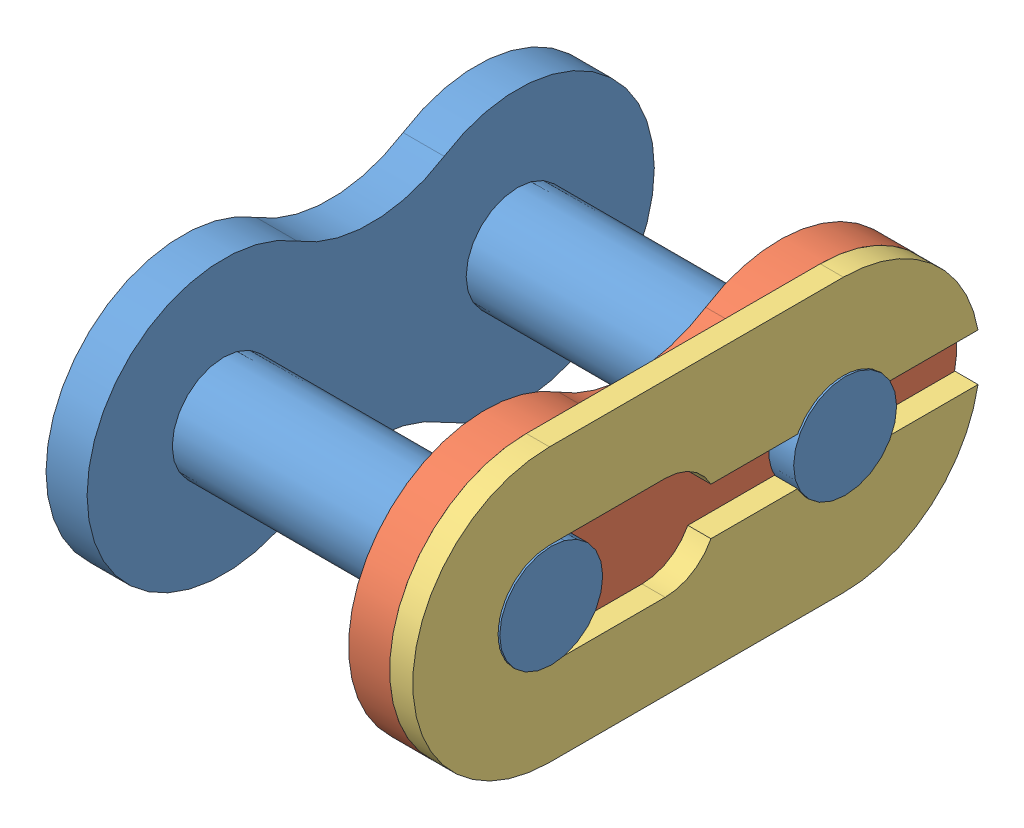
SolidWorks assembly 29.0308 CONNECTING LINK 08B.SLDASM, configuration Default (file format 6000). Lengths in mm.
Overall size (17 11.81 24.51).
3 component instances, 3 part files, 6 mates.
Components (placement in the parent):
- 29.0308 connecting link male-1: 29.0308 connecting link male.SLDPRT [Default] at origin size (17 11.81 24.51)
- 29.0308 connecting link female-1: 29.0308 connecting link female.SLDPRT [Default] at origin size (1.77 11.81 24.51)
- 29.0308 connecting link clip-1: 29.0308 connecting link clip.SLDPRT [Default] at origin size (1 11.81 24.42)
Mates (geometry in assembly coordinates):
- Concentric1: concentric anti-aligned: cylinder of 29.0308 connecting link male-1 through (230.9585 -103.8857 46.65) axis (-1 0 0) radius 2.225; cylinder of 29.0308 connecting link female-1 through (228.996 -103.8857 46.65) axis (1 0 0) radius 2.225
- Concentric2: concentric aligned: cylinder of 29.0308 connecting link male-1 through (230.9585 -103.8857 59.35) axis (-1 0 0) radius 2.225; cylinder of 29.0308 connecting link female-1 through (236.0047 -103.8857 59.35) axis (-1 0 0) radius 2.225
- Distance1: distance = 11.3 mm anti-aligned: plane of 29.0308 connecting link male-1 through (216.8085 -97.9807 53) normal (1 0 0); plane of 29.0308 connecting link female-1 through (228.1085 -97.9807 53) normal (-1 0 0)
- Coincident2: coincident anti-aligned: plane of 29.0308 connecting link female-1 through (229.8835 -97.9807 53) normal (1 0 0); plane of 29.0308 connecting link clip-1 through (229.8835 -103.8857 52.5617) normal (-1 0 0)
- Concentric3: concentric aligned: cylinder of 29.0308 connecting link male-1 through (230.9585 -103.8857 59.35) axis (-1 0 0) radius 2.225; cylinder of 29.0308 connecting link clip-1 through (230.8835 -103.8857 59.35) axis (-1 0 0) radius 2.225
- Concentric4: concentric aligned: cylinder of 29.0308 connecting link male-1 through (230.9585 -103.8857 46.65) axis (-1 0 0) radius 2.225; cylinder of 29.0308 connecting link clip-1 through (230.8835 -103.8857 46.65) axis (-1 0 0) radius 2.225
